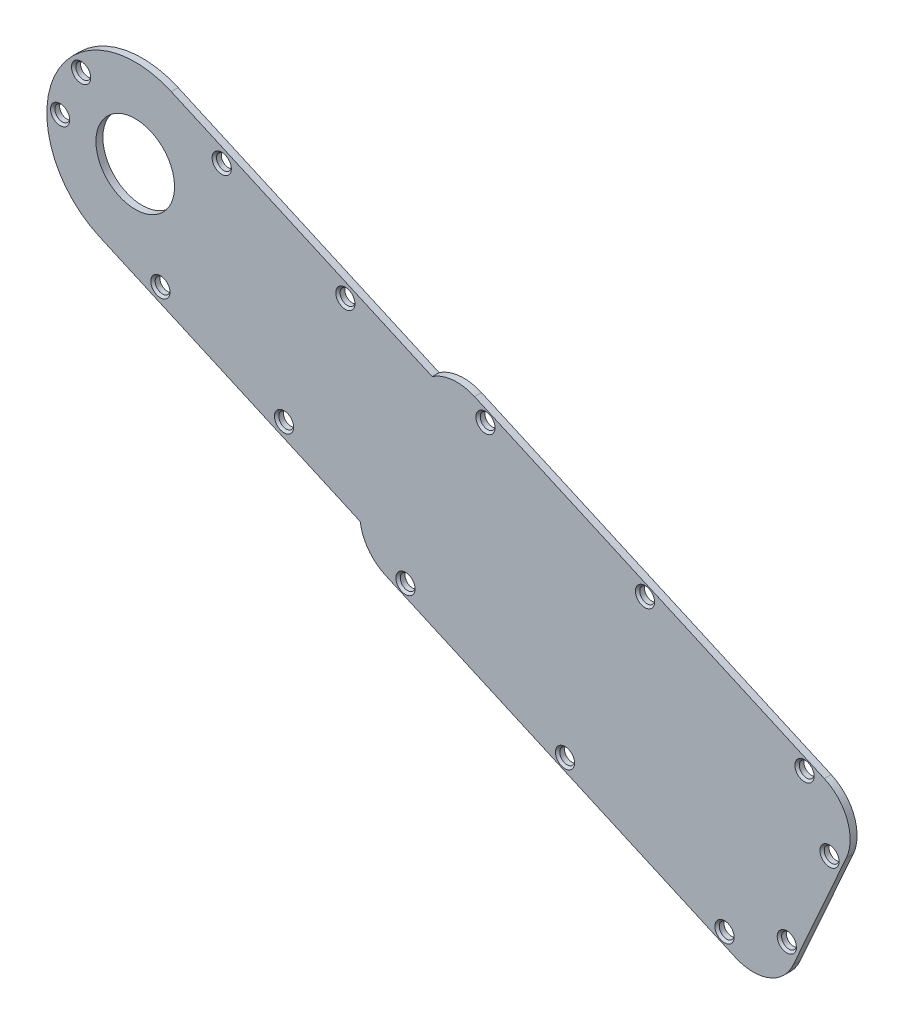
from build123d import *

# Parameters (mm, degrees)
BOSS_EXTRUDE1_DEPTH   = 1.5875
F_4_CLEARANCE_HOLE1_D = 3.4
HOLE1_D               = 18
CHAMFER1_SIZE         = 0.5
FILLET1_R             = 10


with BuildPart() as part:
    # Sketch1 → Boss-Extrude1 (new body)
    with BuildSketch(Plane.XY.offset(1.5875)):
        with BuildLine():
            Line((-122.373252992, 49.591627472), (-33.137949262, 9.81285715))
            Line((-33.137949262, 9.81285715), (-12.780339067, 55.480873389))
            Line((-12.780339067, 55.480873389), (-102.015642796, 95.25964371))
            ThreePointArc((-102.015642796, 95.25964371), (-106.983028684, 96.085831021), (-111.723245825, 94.386463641))
            Line((-111.723245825, 94.386463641), (-171.498000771, 121.032489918))
            ThreePointArc((-171.498000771, 121.032489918), (-198.238379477, 110.781775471), (-187.98766503, 84.041396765))
            Line((-187.98766503, 84.041396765), (-128.212910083, 57.395370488))
            ThreePointArc((-128.212910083, 57.395370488), (-126.308202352, 52.73386896), (-122.373252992, 49.591627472))
        make_face()
    extrude(amount=-BOSS_EXTRUDE1_DEPTH)

    # 4 Clearance Hole1 (through all)
    with Locations(Plane.XY.offset(1.5875)):
        with Locations((-99.517086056, 91.408706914), (-62.982673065, 75.122618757), (-26.448260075, 58.836530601), (-20.722062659, 44.787930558), (-30.493715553, 22.867282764), (-44.77010925, 17.735315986), (-81.304522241, 34.021404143), (-117.838935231, 50.307492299), (-131.618242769, 99.970559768), (-145.664993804, 68.459628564), (-173.979163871, 81.081346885), (-159.932412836, 112.592278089), (-192.145991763, 114.525444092), (-196.950263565, 103.748070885)):
            Hole(F_4_CLEARANCE_HOLE1_D / 2)

    # Hole1 (through all)
    with Locations(Plane(origin=(0, 0, 0), x_dir=(-1, 0, 0), z_dir=(0, 0, -1))):
        with Locations((179.7428329, 102.536943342)):
            Hole(HOLE1_D / 2)

    # Chamfer1
    chamfer1_edges = [part.edges().sort_by_distance(p)[0] for p in [
        (-24.748260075, 58.836530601, 1.5875),
        (-61.282673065, 75.122618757, 1.5875),
        (-97.817086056, 91.408706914, 1.5875),
        (-195.250263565, 103.748070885, 1.5875),
        (-190.445991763, 114.525444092, 1.5875),
        (-158.232412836, 112.592278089, 1.5875),
        (-172.279163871, 81.081346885, 1.5875),
        (-143.964993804, 68.459628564, 1.5875),
        (-129.918242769, 99.970559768, 1.5875),
        (-116.138935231, 50.307492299, 1.5875),
        (-79.604522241, 34.021404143, 1.5875),
        (-43.07010925, 17.735315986, 1.5875),
        (-28.793715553, 22.867282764, 1.5875),
        (-19.022062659, 44.787930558, 1.5875),
    ]]
    chamfer(chamfer1_edges, length=CHAMFER1_SIZE)

    # Fillet1
    fillet1_edges = [part.edges().sort_by_distance(p)[0] for p in [
        (-12.780339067, 55.480873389, 0.79375),
        (-33.137949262, 9.81285715, 0.79375),
    ]]
    fillet(fillet1_edges, radius=FILLET1_R)


solid = part.part
